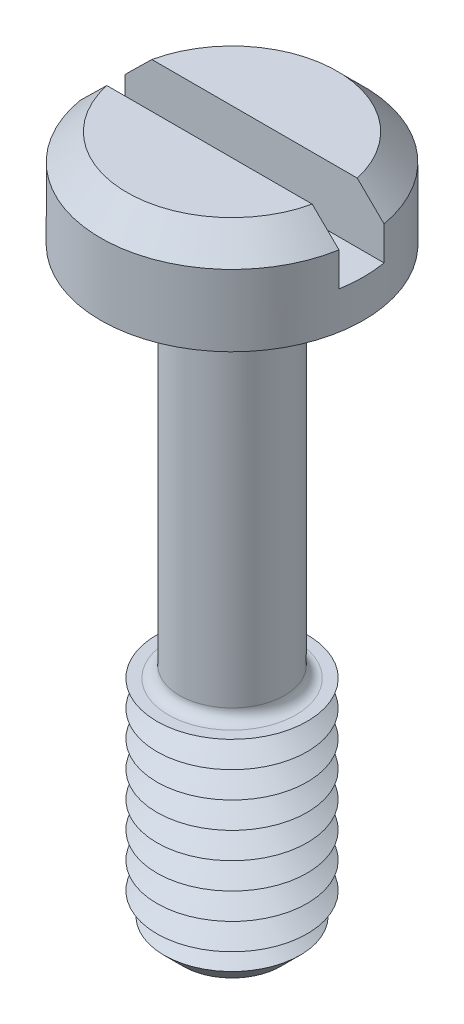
from build123d import *

# Parameters (mm, degrees)
SKETCH1_R           = 3.5
BOSS_EXTRUDE1_DEPTH = 2.6
SKETCH2_R           = 1.4
BOSS_EXTRUDE2_DEPTH = 16
SKETCH3_R           = 2
BOSS_EXTRUDE3_DEPTH = 6
CHAMFER1_SIZE       = 0.7
LPATTERN1_COUNT     = 8
LPATTERN1_PITCH     = 0.7
FILLET1_R           = 0.3
CHAMFER2_SIZE       = 0.7
SKETCH6_W           = 7
SKETCH6_H           = 1.2
CUT_EXTRUDE1_DEPTH  = 1.6


with BuildPart() as part:
    # Sketch1 → Boss-Extrude1 (new body)
    with BuildSketch(Plane(origin=(0, 0, 0), x_dir=(1, 0, 0), z_dir=(0, 1, 0))):
        with Locations(Location((0, 0, 0), (0, 0, 270))):
            Circle(SKETCH1_R)
    extrude(amount=BOSS_EXTRUDE1_DEPTH)

    # Sketch2 → Boss-Extrude2 (add)
    with BuildSketch(Plane.XZ):
        with Locations(Location((0, 0, 0), (0, 0, 270))):
            Circle(SKETCH2_R)
    extrude(amount=BOSS_EXTRUDE2_DEPTH)

    # Sketch3 → Boss-Extrude3 (add)
    with BuildSketch(Plane.XZ.offset(16)):
        with Locations(Location((0, 0, 0), (0, 0, 270))):
            Circle(SKETCH3_R)
    extrude(amount=-BOSS_EXTRUDE3_DEPTH)

    # Chamfer1
    chamfer1_edges = [part.edges().sort_by_distance(p)[0] for p in [
        (0, -16, 2),
    ]]
    chamfer(chamfer1_edges, length=CHAMFER1_SIZE)

    # Sketch5 → Cut-Revolve1 (revolve, cut)
    with BuildSketch(Plane(origin=(0, 0, 0), x_dir=(0, 0, -1), z_dir=(1, 0, 0))):
        Polygon((-2, -10), (-1.393782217, -10.35), (-2, -10.7), align=None)
    cut_revolve1 = revolve(axis=Axis((0, -6.58711856, 0), (0, -1, 0)), mode=Mode.SUBTRACT)

    # LPattern1: Cut-Revolve1 ×8
    with Locations(*[(0, -i * LPATTERN1_PITCH, 0) for i in range(1, LPATTERN1_COUNT)]):
        add(cut_revolve1, mode=Mode.SUBTRACT)

    # Fillet1
    fillet1_edges = [part.edges().sort_by_distance(p)[0] for p in [
        (0, 0, 1.4),
        (0, -10, 1.4),
    ]]
    fillet(fillet1_edges, radius=FILLET1_R)

    # Chamfer2
    chamfer2_edges = [part.edges().sort_by_distance(p)[0] for p in [
        (0, 2.6, -3.5),
    ]]
    chamfer(chamfer2_edges, length=CHAMFER2_SIZE)

    # Sketch6 → Cut-Extrude1 (cut)
    with BuildSketch(Plane(origin=(0, 2.6, 0), x_dir=(1, 0, 0), z_dir=(0, 1, 0))):
        Rectangle(SKETCH6_W, SKETCH6_H)
    extrude(amount=-CUT_EXTRUDE1_DEPTH, mode=Mode.SUBTRACT)


solid = part.part
